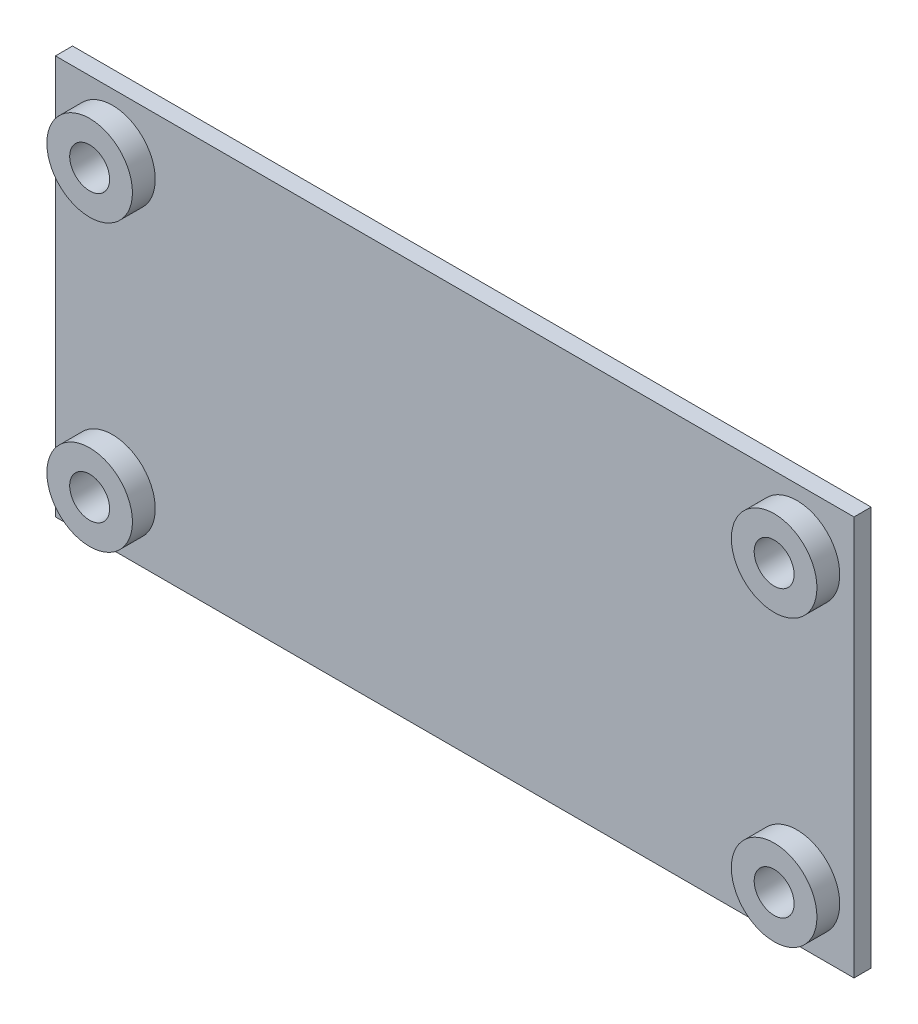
ISO-10303-21;
HEADER;
FILE_DESCRIPTION(('STEP AP214'),'2;1');
FILE_NAME('part.step','',(''),(''),'','','');
FILE_SCHEMA(('AUTOMOTIVE_DESIGN { 1 0 10303 214 1 1 1 1 }'));
ENDSEC;
DATA;
#1=APPLICATION_CONTEXT('core data for automotive mechanical design processes');
#2=APPLICATION_PROTOCOL_DEFINITION('international standard','automotive_design',2000,#1);
#3=PRODUCT_CONTEXT('',#1,'mechanical');
#4=PRODUCT('Part','Part','',(#3));
#5=PRODUCT_RELATED_PRODUCT_CATEGORY('part','',(#4));
#6=PRODUCT_DEFINITION_FORMATION('','',#4);
#7=PRODUCT_DEFINITION_CONTEXT('part definition',#1,'design');
#8=PRODUCT_DEFINITION('design','',#6,#7);
#9=PRODUCT_DEFINITION_SHAPE('','',#8);
#10=(LENGTH_UNIT() NAMED_UNIT(*) SI_UNIT(.MILLI.,.METRE.));
#11=(NAMED_UNIT(*) PLANE_ANGLE_UNIT() SI_UNIT($,.RADIAN.));
#12=(NAMED_UNIT(*) SI_UNIT($,.STERADIAN.) SOLID_ANGLE_UNIT());
#13=UNCERTAINTY_MEASURE_WITH_UNIT(LENGTH_MEASURE(1.E-05),#10,'distance_accuracy_value','');
#14=(GEOMETRIC_REPRESENTATION_CONTEXT(3) GLOBAL_UNCERTAINTY_ASSIGNED_CONTEXT((#13)) GLOBAL_UNIT_ASSIGNED_CONTEXT((#10,
#11,#12)) REPRESENTATION_CONTEXT('',''));
#15=CARTESIAN_POINT('',(0.,0.,0.));
#16=DIRECTION('',(0.,0.,1.));
#17=DIRECTION('',(1.,0.,0.));
#18=AXIS2_PLACEMENT_3D('',#15,#16,#17);
#19=CARTESIAN_POINT('',(0.,35.,1.5));
#20=DIRECTION('',(0.,0.,-1.));
#21=DIRECTION('',(-1.,0.,0.));
#22=AXIS2_PLACEMENT_3D('',#19,#20,#21);
#23=PLANE('',#22);
#24=CARTESIAN_POINT('',(65.,5.,1.5));
#25=DIRECTION('',(0.,0.,-1.));
#26=DIRECTION('',(-1.,0.,0.));
#27=AXIS2_PLACEMENT_3D('',#24,#25,#26);
#28=CIRCLE('',#27,3.75);
#29=CARTESIAN_POINT('',(61.25,5.,1.5));
#30=VERTEX_POINT('',#29);
#31=EDGE_CURVE('E66',#30,#30,#28,.F.);
#32=ORIENTED_EDGE('',*,*,#31,.F.);
#33=EDGE_LOOP('',(#32));
#34=FACE_BOUND('',#33,.T.);
#35=CARTESIAN_POINT('',(5.,30.,1.5));
#36=DIRECTION('',(0.,0.,-1.));
#37=DIRECTION('',(-1.,0.,0.));
#38=AXIS2_PLACEMENT_3D('',#35,#36,#37);
#39=CIRCLE('',#38,3.75);
#40=CARTESIAN_POINT('',(1.25,30.,1.5));
#41=VERTEX_POINT('',#40);
#42=EDGE_CURVE('E135',#41,#41,#39,.F.);
#43=ORIENTED_EDGE('',*,*,#42,.F.);
#44=EDGE_LOOP('',(#43));
#45=FACE_BOUND('',#44,.T.);
#46=DIRECTION('',(0.,-1.,0.));
#47=VECTOR('',#46,1.);
#48=CARTESIAN_POINT('',(0.,0.,1.5));
#49=LINE('',#48,#47);
#50=CARTESIAN_POINT('',(0.,35.,1.5));
#51=VERTEX_POINT('',#50);
#52=CARTESIAN_POINT('',(0.,0.,1.5));
#53=VERTEX_POINT('',#52);
#54=EDGE_CURVE('E110',#51,#53,#49,.T.);
#55=ORIENTED_EDGE('',*,*,#54,.T.);
#56=DIRECTION('',(1.,0.,0.));
#57=VECTOR('',#56,1.);
#58=CARTESIAN_POINT('',(0.,0.,1.5));
#59=LINE('',#58,#57);
#60=CARTESIAN_POINT('',(70.,0.,1.5));
#61=VERTEX_POINT('',#60);
#62=EDGE_CURVE('E105',#53,#61,#59,.T.);
#63=ORIENTED_EDGE('',*,*,#62,.T.);
#64=DIRECTION('',(0.,1.,0.));
#65=VECTOR('',#64,1.);
#66=CARTESIAN_POINT('',(70.,0.,1.5));
#67=LINE('',#66,#65);
#68=CARTESIAN_POINT('',(70.,35.,1.5));
#69=VERTEX_POINT('',#68);
#70=EDGE_CURVE('E108',#61,#69,#67,.T.);
#71=ORIENTED_EDGE('',*,*,#70,.T.);
#72=DIRECTION('',(-1.,0.,0.));
#73=VECTOR('',#72,1.);
#74=CARTESIAN_POINT('',(0.,35.,1.5));
#75=LINE('',#74,#73);
#76=EDGE_CURVE('E74',#69,#51,#75,.T.);
#77=ORIENTED_EDGE('',*,*,#76,.T.);
#78=EDGE_LOOP('',(#55,#63,#71,#77));
#79=FACE_BOUND('',#78,.T.);
#80=CARTESIAN_POINT('',(5.,5.,1.5));
#81=DIRECTION('',(0.,0.,-1.));
#82=DIRECTION('',(-1.,0.,0.));
#83=AXIS2_PLACEMENT_3D('',#80,#81,#82);
#84=CIRCLE('',#83,3.75);
#85=CARTESIAN_POINT('',(1.25,5.,1.5));
#86=VERTEX_POINT('',#85);
#87=EDGE_CURVE('E138',#86,#86,#84,.F.);
#88=ORIENTED_EDGE('',*,*,#87,.F.);
#89=EDGE_LOOP('',(#88));
#90=FACE_BOUND('',#89,.T.);
#91=CARTESIAN_POINT('',(65.,30.,1.5));
#92=DIRECTION('',(0.,0.,-1.));
#93=DIRECTION('',(-1.,0.,0.));
#94=AXIS2_PLACEMENT_3D('',#91,#92,#93);
#95=CIRCLE('',#94,3.75);
#96=CARTESIAN_POINT('',(61.25,30.,1.5));
#97=VERTEX_POINT('',#96);
#98=EDGE_CURVE('E12',#97,#97,#95,.F.);
#99=ORIENTED_EDGE('',*,*,#98,.F.);
#100=EDGE_LOOP('',(#99));
#101=FACE_BOUND('',#100,.T.);
#102=ADVANCED_FACE('F57',(#34,#45,#79,#90,#101),#23,.F.);
#103=CARTESIAN_POINT('',(0.,35.,0.));
#104=DIRECTION('',(0.,0.,-1.));
#105=DIRECTION('',(-1.,0.,0.));
#106=AXIS2_PLACEMENT_3D('',#103,#104,#105);
#107=PLANE('',#106);
#108=CARTESIAN_POINT('',(65.,30.,0.));
#109=DIRECTION('',(0.,0.,1.));
#110=DIRECTION('',(1.,0.,0.));
#111=AXIS2_PLACEMENT_3D('',#108,#109,#110);
#112=CIRCLE('',#111,1.75);
#113=CARTESIAN_POINT('',(66.75,30.,0.));
#114=VERTEX_POINT('',#113);
#115=EDGE_CURVE('E209',#114,#114,#112,.T.);
#116=ORIENTED_EDGE('',*,*,#115,.T.);
#117=EDGE_LOOP('',(#116));
#118=FACE_BOUND('',#117,.T.);
#119=CARTESIAN_POINT('',(5.,5.,0.));
#120=DIRECTION('',(0.,0.,1.));
#121=DIRECTION('',(1.,0.,0.));
#122=AXIS2_PLACEMENT_3D('',#119,#120,#121);
#123=CIRCLE('',#122,1.75);
#124=CARTESIAN_POINT('',(6.75,5.,0.));
#125=VERTEX_POINT('',#124);
#126=EDGE_CURVE('E128',#125,#125,#123,.T.);
#127=ORIENTED_EDGE('',*,*,#126,.T.);
#128=EDGE_LOOP('',(#127));
#129=FACE_BOUND('',#128,.T.);
#130=DIRECTION('',(0.,-1.,0.));
#131=VECTOR('',#130,1.);
#132=CARTESIAN_POINT('',(0.,0.,0.));
#133=LINE('',#132,#131);
#134=CARTESIAN_POINT('',(0.,35.,0.));
#135=VERTEX_POINT('',#134);
#136=CARTESIAN_POINT('',(0.,0.,0.));
#137=VERTEX_POINT('',#136);
#138=EDGE_CURVE('E125',#135,#137,#133,.T.);
#139=ORIENTED_EDGE('',*,*,#138,.F.);
#140=DIRECTION('',(-1.,0.,0.));
#141=VECTOR('',#140,1.);
#142=CARTESIAN_POINT('',(0.,35.,0.));
#143=LINE('',#142,#141);
#144=CARTESIAN_POINT('',(70.,35.,0.));
#145=VERTEX_POINT('',#144);
#146=EDGE_CURVE('E97',#145,#135,#143,.T.);
#147=ORIENTED_EDGE('',*,*,#146,.F.);
#148=DIRECTION('',(0.,1.,0.));
#149=VECTOR('',#148,1.);
#150=CARTESIAN_POINT('',(70.,0.,0.));
#151=LINE('',#150,#149);
#152=CARTESIAN_POINT('',(70.,0.,0.));
#153=VERTEX_POINT('',#152);
#154=EDGE_CURVE('E91',#153,#145,#151,.T.);
#155=ORIENTED_EDGE('',*,*,#154,.F.);
#156=DIRECTION('',(1.,0.,0.));
#157=VECTOR('',#156,1.);
#158=CARTESIAN_POINT('',(0.,0.,0.));
#159=LINE('',#158,#157);
#160=EDGE_CURVE('E115',#137,#153,#159,.T.);
#161=ORIENTED_EDGE('',*,*,#160,.F.);
#162=EDGE_LOOP('',(#139,#147,#155,#161));
#163=FACE_BOUND('',#162,.T.);
#164=CARTESIAN_POINT('',(5.,30.,0.));
#165=DIRECTION('',(0.,0.,1.));
#166=DIRECTION('',(1.,0.,0.));
#167=AXIS2_PLACEMENT_3D('',#164,#165,#166);
#168=CIRCLE('',#167,1.75);
#169=CARTESIAN_POINT('',(6.75,30.,0.));
#170=VERTEX_POINT('',#169);
#171=EDGE_CURVE('E205',#170,#170,#168,.T.);
#172=ORIENTED_EDGE('',*,*,#171,.T.);
#173=EDGE_LOOP('',(#172));
#174=FACE_BOUND('',#173,.T.);
#175=CARTESIAN_POINT('',(65.,5.,0.));
#176=DIRECTION('',(0.,0.,1.));
#177=DIRECTION('',(1.,0.,0.));
#178=AXIS2_PLACEMENT_3D('',#175,#176,#177);
#179=CIRCLE('',#178,1.75);
#180=CARTESIAN_POINT('',(66.75,5.,0.));
#181=VERTEX_POINT('',#180);
#182=EDGE_CURVE('E208',#181,#181,#179,.T.);
#183=ORIENTED_EDGE('',*,*,#182,.T.);
#184=EDGE_LOOP('',(#183));
#185=FACE_BOUND('',#184,.T.);
#186=ADVANCED_FACE('F147',(#118,#129,#163,#174,#185),#107,.T.);
#187=CARTESIAN_POINT('',(0.,0.,1.5));
#188=DIRECTION('',(1.,0.,0.));
#189=DIRECTION('',(0.,0.,-1.));
#190=AXIS2_PLACEMENT_3D('',#187,#188,#189);
#191=PLANE('',#190);
#192=ORIENTED_EDGE('',*,*,#138,.T.);
#193=DIRECTION('',(0.,0.,-1.));
#194=VECTOR('',#193,1.);
#195=CARTESIAN_POINT('',(0.,0.,1.5));
#196=LINE('',#195,#194);
#197=EDGE_CURVE('E116',#53,#137,#196,.T.);
#198=ORIENTED_EDGE('',*,*,#197,.F.);
#199=ORIENTED_EDGE('',*,*,#54,.F.);
#200=DIRECTION('',(0.,0.,-1.));
#201=VECTOR('',#200,1.);
#202=CARTESIAN_POINT('',(0.,35.,1.5));
#203=LINE('',#202,#201);
#204=EDGE_CURVE('E121',#51,#135,#203,.T.);
#205=ORIENTED_EDGE('',*,*,#204,.T.);
#206=EDGE_LOOP('',(#192,#198,#199,#205));
#207=FACE_BOUND('',#206,.T.);
#208=ADVANCED_FACE('F59',(#207),#191,.F.);
#209=CARTESIAN_POINT('',(0.,0.,1.5));
#210=DIRECTION('',(0.,1.,0.));
#211=DIRECTION('',(0.,0.,1.));
#212=AXIS2_PLACEMENT_3D('',#209,#210,#211);
#213=PLANE('',#212);
#214=ORIENTED_EDGE('',*,*,#160,.T.);
#215=DIRECTION('',(0.,0.,-1.));
#216=VECTOR('',#215,1.);
#217=CARTESIAN_POINT('',(70.,0.,1.5));
#218=LINE('',#217,#216);
#219=EDGE_CURVE('E113',#61,#153,#218,.T.);
#220=ORIENTED_EDGE('',*,*,#219,.F.);
#221=ORIENTED_EDGE('',*,*,#62,.F.);
#222=ORIENTED_EDGE('',*,*,#197,.T.);
#223=EDGE_LOOP('',(#214,#220,#221,#222));
#224=FACE_BOUND('',#223,.T.);
#225=ADVANCED_FACE('F114',(#224),#213,.F.);
#226=CARTESIAN_POINT('',(70.,0.,1.5));
#227=DIRECTION('',(-1.,0.,0.));
#228=DIRECTION('',(0.,0.,1.));
#229=AXIS2_PLACEMENT_3D('',#226,#227,#228);
#230=PLANE('',#229);
#231=ORIENTED_EDGE('',*,*,#154,.T.);
#232=DIRECTION('',(0.,0.,-1.));
#233=VECTOR('',#232,1.);
#234=CARTESIAN_POINT('',(70.,35.,1.5));
#235=LINE('',#234,#233);
#236=EDGE_CURVE('E117',#69,#145,#235,.T.);
#237=ORIENTED_EDGE('',*,*,#236,.F.);
#238=ORIENTED_EDGE('',*,*,#70,.F.);
#239=ORIENTED_EDGE('',*,*,#219,.T.);
#240=EDGE_LOOP('',(#231,#237,#238,#239));
#241=FACE_BOUND('',#240,.T.);
#242=ADVANCED_FACE('F119',(#241),#230,.F.);
#243=CARTESIAN_POINT('',(0.,35.,1.5));
#244=DIRECTION('',(0.,-1.,0.));
#245=DIRECTION('',(0.,0.,-1.));
#246=AXIS2_PLACEMENT_3D('',#243,#244,#245);
#247=PLANE('',#246);
#248=ORIENTED_EDGE('',*,*,#146,.T.);
#249=ORIENTED_EDGE('',*,*,#204,.F.);
#250=ORIENTED_EDGE('',*,*,#76,.F.);
#251=ORIENTED_EDGE('',*,*,#236,.T.);
#252=EDGE_LOOP('',(#248,#249,#250,#251));
#253=FACE_BOUND('',#252,.T.);
#254=ADVANCED_FACE('F183',(#253),#247,.F.);
#255=CARTESIAN_POINT('',(5.,5.,1.5));
#256=DIRECTION('',(0.,0.,-1.));
#257=DIRECTION('',(-1.,0.,0.));
#258=AXIS2_PLACEMENT_3D('',#255,#256,#257);
#259=CYLINDRICAL_SURFACE('',#258,1.75);
#260=ORIENTED_EDGE('',*,*,#126,.F.);
#261=EDGE_LOOP('',(#260));
#262=FACE_BOUND('',#261,.T.);
#263=CARTESIAN_POINT('',(5.,5.,3.5));
#264=DIRECTION('',(0.,0.,1.));
#265=DIRECTION('',(1.,0.,0.));
#266=AXIS2_PLACEMENT_3D('',#263,#264,#265);
#267=CIRCLE('',#266,1.75);
#268=CARTESIAN_POINT('',(6.75,5.,3.5));
#269=VERTEX_POINT('',#268);
#270=EDGE_CURVE('E226',#269,#269,#267,.T.);
#271=ORIENTED_EDGE('',*,*,#270,.T.);
#272=EDGE_LOOP('',(#271));
#273=FACE_BOUND('',#272,.T.);
#274=ADVANCED_FACE('F180',(#262,#273),#259,.F.);
#275=CARTESIAN_POINT('',(5.,30.,1.5));
#276=DIRECTION('',(0.,0.,-1.));
#277=DIRECTION('',(-1.,0.,0.));
#278=AXIS2_PLACEMENT_3D('',#275,#276,#277);
#279=CYLINDRICAL_SURFACE('',#278,1.75);
#280=ORIENTED_EDGE('',*,*,#171,.F.);
#281=EDGE_LOOP('',(#280));
#282=FACE_BOUND('',#281,.T.);
#283=CARTESIAN_POINT('',(5.,30.,3.5));
#284=DIRECTION('',(0.,0.,1.));
#285=DIRECTION('',(1.,0.,0.));
#286=AXIS2_PLACEMENT_3D('',#283,#284,#285);
#287=CIRCLE('',#286,1.75);
#288=CARTESIAN_POINT('',(6.75,30.,3.5));
#289=VERTEX_POINT('',#288);
#290=EDGE_CURVE('E215',#289,#289,#287,.T.);
#291=ORIENTED_EDGE('',*,*,#290,.T.);
#292=EDGE_LOOP('',(#291));
#293=FACE_BOUND('',#292,.T.);
#294=ADVANCED_FACE('F176',(#282,#293),#279,.F.);
#295=CARTESIAN_POINT('',(65.,30.,1.5));
#296=DIRECTION('',(0.,0.,-1.));
#297=DIRECTION('',(-1.,0.,0.));
#298=AXIS2_PLACEMENT_3D('',#295,#296,#297);
#299=CYLINDRICAL_SURFACE('',#298,1.75);
#300=ORIENTED_EDGE('',*,*,#115,.F.);
#301=EDGE_LOOP('',(#300));
#302=FACE_BOUND('',#301,.T.);
#303=CARTESIAN_POINT('',(65.,30.,3.5));
#304=DIRECTION('',(0.,0.,1.));
#305=DIRECTION('',(1.,0.,0.));
#306=AXIS2_PLACEMENT_3D('',#303,#304,#305);
#307=CIRCLE('',#306,1.75);
#308=CARTESIAN_POINT('',(66.75,30.,3.5));
#309=VERTEX_POINT('',#308);
#310=EDGE_CURVE('E246',#309,#309,#307,.T.);
#311=ORIENTED_EDGE('',*,*,#310,.T.);
#312=EDGE_LOOP('',(#311));
#313=FACE_BOUND('',#312,.T.);
#314=ADVANCED_FACE('F172',(#302,#313),#299,.F.);
#315=CARTESIAN_POINT('',(65.,5.,1.5));
#316=DIRECTION('',(0.,0.,-1.));
#317=DIRECTION('',(-1.,0.,0.));
#318=AXIS2_PLACEMENT_3D('',#315,#316,#317);
#319=CYLINDRICAL_SURFACE('',#318,1.75);
#320=ORIENTED_EDGE('',*,*,#182,.F.);
#321=EDGE_LOOP('',(#320));
#322=FACE_BOUND('',#321,.T.);
#323=CARTESIAN_POINT('',(65.,5.,3.5));
#324=DIRECTION('',(0.,0.,1.));
#325=DIRECTION('',(1.,0.,0.));
#326=AXIS2_PLACEMENT_3D('',#323,#324,#325);
#327=CIRCLE('',#326,1.75);
#328=CARTESIAN_POINT('',(66.75,5.,3.5));
#329=VERTEX_POINT('',#328);
#330=EDGE_CURVE('E234',#329,#329,#327,.T.);
#331=ORIENTED_EDGE('',*,*,#330,.T.);
#332=EDGE_LOOP('',(#331));
#333=FACE_BOUND('',#332,.T.);
#334=ADVANCED_FACE('F164',(#322,#333),#319,.F.);
#335=CARTESIAN_POINT('',(5.,30.,3.5));
#336=DIRECTION('',(0.,0.,1.));
#337=DIRECTION('',(1.,0.,0.));
#338=AXIS2_PLACEMENT_3D('',#335,#336,#337);
#339=PLANE('',#338);
#340=CARTESIAN_POINT('',(5.,30.,3.5));
#341=DIRECTION('',(0.,0.,1.));
#342=DIRECTION('',(1.,0.,0.));
#343=AXIS2_PLACEMENT_3D('',#340,#341,#342);
#344=CIRCLE('',#343,3.75);
#345=CARTESIAN_POINT('',(8.75,30.,3.5));
#346=VERTEX_POINT('',#345);
#347=EDGE_CURVE('E210',#346,#346,#344,.T.);
#348=ORIENTED_EDGE('',*,*,#347,.T.);
#349=EDGE_LOOP('',(#348));
#350=FACE_BOUND('',#349,.T.);
#351=ORIENTED_EDGE('',*,*,#290,.F.);
#352=EDGE_LOOP('',(#351));
#353=FACE_BOUND('',#352,.T.);
#354=ADVANCED_FACE('F154',(#350,#353),#339,.T.);
#355=CARTESIAN_POINT('',(5.,30.,3.5));
#356=DIRECTION('',(0.,0.,-1.));
#357=DIRECTION('',(-1.,0.,0.));
#358=AXIS2_PLACEMENT_3D('',#355,#356,#357);
#359=CYLINDRICAL_SURFACE('',#358,3.75);
#360=ORIENTED_EDGE('',*,*,#347,.F.);
#361=EDGE_LOOP('',(#360));
#362=FACE_BOUND('',#361,.T.);
#363=ORIENTED_EDGE('',*,*,#42,.T.);
#364=EDGE_LOOP('',(#363));
#365=FACE_BOUND('',#364,.T.);
#366=ADVANCED_FACE('F151',(#362,#365),#359,.T.);
#367=CARTESIAN_POINT('',(5.,5.,3.5));
#368=DIRECTION('',(0.,0.,1.));
#369=DIRECTION('',(1.,0.,0.));
#370=AXIS2_PLACEMENT_3D('',#367,#368,#369);
#371=PLANE('',#370);
#372=CARTESIAN_POINT('',(5.,5.,3.5));
#373=DIRECTION('',(0.,0.,1.));
#374=DIRECTION('',(1.,0.,0.));
#375=AXIS2_PLACEMENT_3D('',#372,#373,#374);
#376=CIRCLE('',#375,3.75);
#377=CARTESIAN_POINT('',(8.75,5.,3.5));
#378=VERTEX_POINT('',#377);
#379=EDGE_CURVE('E228',#378,#378,#376,.T.);
#380=ORIENTED_EDGE('',*,*,#379,.T.);
#381=EDGE_LOOP('',(#380));
#382=FACE_BOUND('',#381,.T.);
#383=ORIENTED_EDGE('',*,*,#270,.F.);
#384=EDGE_LOOP('',(#383));
#385=FACE_BOUND('',#384,.T.);
#386=ADVANCED_FACE('F153',(#382,#385),#371,.T.);
#387=CARTESIAN_POINT('',(5.,5.,3.5));
#388=DIRECTION('',(0.,0.,-1.));
#389=DIRECTION('',(-1.,0.,0.));
#390=AXIS2_PLACEMENT_3D('',#387,#388,#389);
#391=CYLINDRICAL_SURFACE('',#390,3.75);
#392=ORIENTED_EDGE('',*,*,#379,.F.);
#393=EDGE_LOOP('',(#392));
#394=FACE_BOUND('',#393,.T.);
#395=ORIENTED_EDGE('',*,*,#87,.T.);
#396=EDGE_LOOP('',(#395));
#397=FACE_BOUND('',#396,.T.);
#398=ADVANCED_FACE('F161',(#394,#397),#391,.T.);
#399=CARTESIAN_POINT('',(65.,5.,3.5));
#400=DIRECTION('',(0.,0.,1.));
#401=DIRECTION('',(1.,0.,0.));
#402=AXIS2_PLACEMENT_3D('',#399,#400,#401);
#403=PLANE('',#402);
#404=CARTESIAN_POINT('',(65.,5.,3.5));
#405=DIRECTION('',(0.,0.,1.));
#406=DIRECTION('',(1.,0.,0.));
#407=AXIS2_PLACEMENT_3D('',#404,#405,#406);
#408=CIRCLE('',#407,3.75);
#409=CARTESIAN_POINT('',(68.75,5.,3.5));
#410=VERTEX_POINT('',#409);
#411=EDGE_CURVE('E229',#410,#410,#408,.T.);
#412=ORIENTED_EDGE('',*,*,#411,.T.);
#413=EDGE_LOOP('',(#412));
#414=FACE_BOUND('',#413,.T.);
#415=ORIENTED_EDGE('',*,*,#330,.F.);
#416=EDGE_LOOP('',(#415));
#417=FACE_BOUND('',#416,.T.);
#418=ADVANCED_FACE('F262',(#414,#417),#403,.T.);
#419=CARTESIAN_POINT('',(65.,5.,3.5));
#420=DIRECTION('',(0.,0.,-1.));
#421=DIRECTION('',(-1.,0.,0.));
#422=AXIS2_PLACEMENT_3D('',#419,#420,#421);
#423=CYLINDRICAL_SURFACE('',#422,3.75);
#424=ORIENTED_EDGE('',*,*,#411,.F.);
#425=EDGE_LOOP('',(#424));
#426=FACE_BOUND('',#425,.T.);
#427=ORIENTED_EDGE('',*,*,#31,.T.);
#428=EDGE_LOOP('',(#427));
#429=FACE_BOUND('',#428,.T.);
#430=ADVANCED_FACE('F143',(#426,#429),#423,.T.);
#431=CARTESIAN_POINT('',(65.,30.,3.5));
#432=DIRECTION('',(0.,0.,1.));
#433=DIRECTION('',(1.,0.,0.));
#434=AXIS2_PLACEMENT_3D('',#431,#432,#433);
#435=PLANE('',#434);
#436=CARTESIAN_POINT('',(65.,30.,3.5));
#437=DIRECTION('',(0.,0.,1.));
#438=DIRECTION('',(1.,0.,0.));
#439=AXIS2_PLACEMENT_3D('',#436,#437,#438);
#440=CIRCLE('',#439,3.75);
#441=CARTESIAN_POINT('',(68.75,30.,3.5));
#442=VERTEX_POINT('',#441);
#443=EDGE_CURVE('E243',#442,#442,#440,.T.);
#444=ORIENTED_EDGE('',*,*,#443,.T.);
#445=EDGE_LOOP('',(#444));
#446=FACE_BOUND('',#445,.T.);
#447=ORIENTED_EDGE('',*,*,#310,.F.);
#448=EDGE_LOOP('',(#447));
#449=FACE_BOUND('',#448,.T.);
#450=ADVANCED_FACE('F251',(#446,#449),#435,.T.);
#451=CARTESIAN_POINT('',(65.,30.,3.5));
#452=DIRECTION('',(0.,0.,-1.));
#453=DIRECTION('',(-1.,0.,0.));
#454=AXIS2_PLACEMENT_3D('',#451,#452,#453);
#455=CYLINDRICAL_SURFACE('',#454,3.75);
#456=ORIENTED_EDGE('',*,*,#443,.F.);
#457=EDGE_LOOP('',(#456));
#458=FACE_BOUND('',#457,.T.);
#459=ORIENTED_EDGE('',*,*,#98,.T.);
#460=EDGE_LOOP('',(#459));
#461=FACE_BOUND('',#460,.T.);
#462=ADVANCED_FACE('F253',(#458,#461),#455,.T.);
#463=CLOSED_SHELL('',(#102,#186,#208,#225,#242,#254,#274,#294,#314,#334,#354,#366,#386,#398,
#418,#430,#450,#462));
#464=MANIFOLD_SOLID_BREP('B2',#463);
#465=ADVANCED_BREP_SHAPE_REPRESENTATION('',(#18,#464),#14);
#466=SHAPE_DEFINITION_REPRESENTATION(#9,#465);
ENDSEC;
END-ISO-10303-21;
